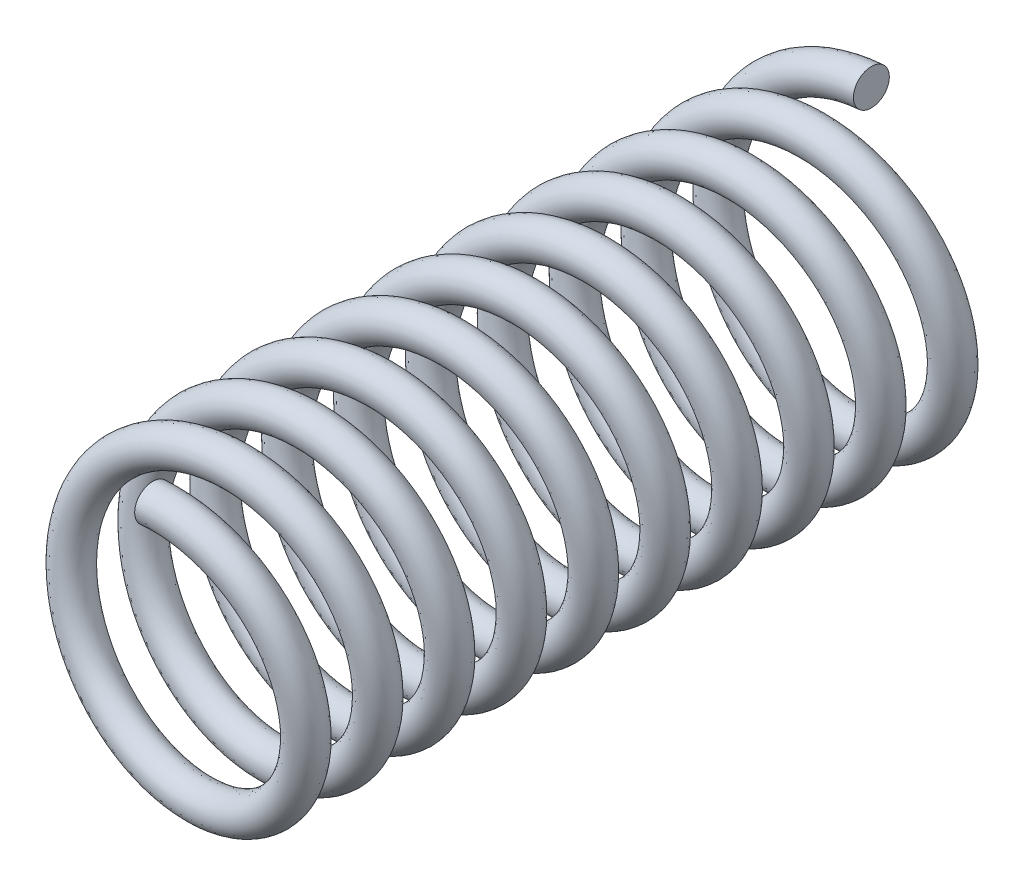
from build123d import *

# Parameters (mm, degrees)
AUSTRAGUNG1_PITCH       = 20
AUSTRAGUNG1_HEIGHT      = 200
AUSTRAGUNG1_RADIUS      = 37.5
AUSTRAGUNG1_START_ANGLE = 90
SKIZZE2_R               = 5


with BuildPart() as part:
    # Austragung1: sweep along a helix
    with BuildLine() as austragung1_path:
        add(Helix(AUSTRAGUNG1_PITCH, AUSTRAGUNG1_HEIGHT, AUSTRAGUNG1_RADIUS, center=(0, 0, 0), direction=(0, 0, -1), mode=Mode.PRIVATE).rotate(Axis((0, 0, 0), (0, 0, -1)), AUSTRAGUNG1_START_ANGLE))
    # Skizze2 → Austragung1 (sweep)
    with BuildSketch(Plane(origin=(0, 0, 0), x_dir=(0, 0, -1), z_dir=(1, 0, 0))):
        with Locations((0, 37.5)):
            Circle(SKIZZE2_R)
    sweep(path=austragung1_path.line, is_frenet=True)


solid = part.part
